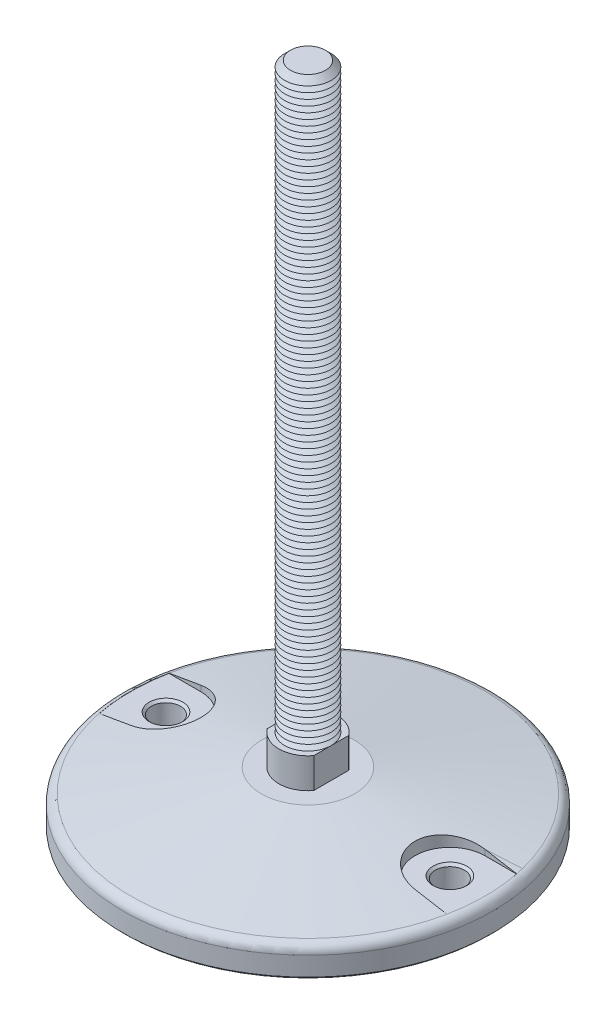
from build123d import *

# Parameters (mm, degrees)
FILLET1_R                = 4
SKETCH3_R                = 12.5
BOSS_EXTRUDE1_DEPTH      = 13
CUT_EXTRUDE1_START       = -13
CUT_EXTRUDE1_DEPTH       = 13
SKETCH5_R                = 10
BOSS_EXTRUDE2_DEPTH      = 250
CHAMFER1_SIZE            = 2.5
LPATTERN1_COUNT          = 99
LPATTERN1_PITCH          = 2.5
CUT_EXTRUDE4_DEPTH       = 10
SKETCH10_R               = 6.25
CUT_EXTRUDE5_DEPTH       = 13
CHAMFER2_SIZE            = 1
CHAMFER2_OF_MIRROR1_SIZE = 1
CHAMFER3_SIZE            = 1


with BuildPart() as part:
    # Sketch2 → Revolve1 (revolve)
    with BuildSketch(Plane(origin=(0, 0, 0), x_dir=(0, 0, -1), z_dir=(1, 0, 0)), mode=Mode.PRIVATE) as revolve1_sk:
        Polygon((0, 0), (-20, 0), (-79.5, -10.491455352), (-79.5, -23), (0, -23), align=None)
    revolve(revolve1_sk.sketch.rotate(Axis((0, 61.338865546, 0), (0, -1, 0)), 180), axis=Axis((0, 61.338865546, 0), (0, -1, 0)))

    # Fillet1
    fillet1_edges = [part.edges().sort_by_distance(p)[0] for p in [
        (0, -10.491455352, 79.5),
    ]]
    fillet(fillet1_edges, radius=FILLET1_R)

    # Sketch3 → Boss-Extrude1 (add)
    with BuildSketch(Plane(origin=(0, 0, 0), x_dir=(1, 0, 0), z_dir=(0, 1, 0))):
        with Locations(Location((0, 0, 0), (0, 0, 90))):
            Circle(SKETCH3_R)
    extrude(amount=BOSS_EXTRUDE1_DEPTH)

    # Sketch4 → Cut-Extrude1 (cut)
    with BuildSketch(Plane(origin=(0, 13, 0), x_dir=(1, 0, 0), z_dir=(0, 1, 0)).offset(CUT_EXTRUDE1_START)):
        with BuildLine():
            Line((-10, 7.5), (-10, -7.5))
            ThreePointArc((-10, -7.5), (-12.5, 0), (-10, 7.5))
        make_face()
        with BuildLine():
            Line((10, -7.5), (10, 7.5))
            ThreePointArc((10, 7.5), (12.5, 0), (10, -7.5))
        make_face()
    extrude(amount=CUT_EXTRUDE1_DEPTH, mode=Mode.SUBTRACT)

    # Sketch5 → Boss-Extrude2 (add)
    with BuildSketch(Plane(origin=(0, 13, 0), x_dir=(1, 0, 0), z_dir=(0, 1, 0))):
        with Locations(Location((0, 0, 0), (0, 0, 180))):
            Circle(SKETCH5_R)
    extrude(amount=BOSS_EXTRUDE2_DEPTH)

    # Chamfer1
    chamfer1_edges = [part.edges().sort_by_distance(p)[0] for p in [
        (10, 263, 0),
    ]]
    chamfer(chamfer1_edges, length=CHAMFER1_SIZE)

    # Sketch6 → Cut-Revolve1 (revolve, cut)
    with BuildSketch(Plane(origin=(0, 0, 0), x_dir=(0, 0, -1), z_dir=(1, 0, 0))):
        Polygon((-10, 13), (-7.834936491, 14.25), (-10, 15.5), align=None)
    cut_revolve1 = revolve(axis=Axis((0, 61.338865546, 0), (0, -1, 0)), mode=Mode.SUBTRACT)

    # LPattern1: Cut-Revolve1 ×99
    with Locations(*[(0, i * LPATTERN1_PITCH, 0) for i in range(1, LPATTERN1_COUNT)]):
        add(cut_revolve1, mode=Mode.SUBTRACT)

    # Sketch8 → Cut-Extrude4 (cut)
    with BuildSketch(Plane(origin=(0, 0, 0), x_dir=(1, 0, 0), z_dir=(0, 1, 0))):
        with BuildLine():
            Line((-61, 15), (-74.703520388, 15))
            ThreePointArc((-74.703520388, 15), (-76.194592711, 0), (-74.703520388, -15))
            Line((-74.703520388, -15), (-61, -15))
            ThreePointArc((-61, -15), (-46, 0), (-61, 15))
        make_face()
    cut_extrude4 = extrude(amount=-CUT_EXTRUDE4_DEPTH, mode=Mode.SUBTRACT)

    # Sketch10 → Cut-Extrude5 (cut)
    with BuildSketch(Plane(origin=(0, -10, 0), x_dir=(1, 0, 0), z_dir=(0, 1, 0))):
        with Locations(Location((-61, 0, 0), (0, 0, 270))):
            Circle(SKETCH10_R)
    cut_extrude5 = extrude(amount=-CUT_EXTRUDE5_DEPTH, mode=Mode.SUBTRACT)

    # Chamfer2
    chamfer2_edges = [part.edges().sort_by_distance(p)[0] for p in [
        (-61, -10, -6.25),
        (-61, -23, -6.25),
    ]]
    chamfer(chamfer2_edges, length=CHAMFER2_SIZE)

    # Mirror1: Cut-Extrude4, Cut-Extrude5 across plane
    add(cut_extrude4.mirror(Plane(origin=(0, 0, 0), x_dir=(0, 0, 1), z_dir=(1, 0, 0))), mode=Mode.SUBTRACT)
    add(cut_extrude5.mirror(Plane(origin=(0, 0, 0), x_dir=(0, 0, 1), z_dir=(1, 0, 0))), mode=Mode.SUBTRACT)

    # Chamfer2 of Mirror1
    chamfer2_of_mirror1_edges = [part.edges().sort_by_distance(p)[0] for p in [
        (61, -10, -6.25),
        (61, -23, -6.25),
    ]]
    chamfer(chamfer2_of_mirror1_edges, length=CHAMFER2_OF_MIRROR1_SIZE)

    # Chamfer3
    chamfer3_edges = [part.edges().sort_by_distance(p)[0] for p in [
        (0, -23, 79.5),
    ]]
    chamfer(chamfer3_edges, length=CHAMFER3_SIZE)


solid = part.part
